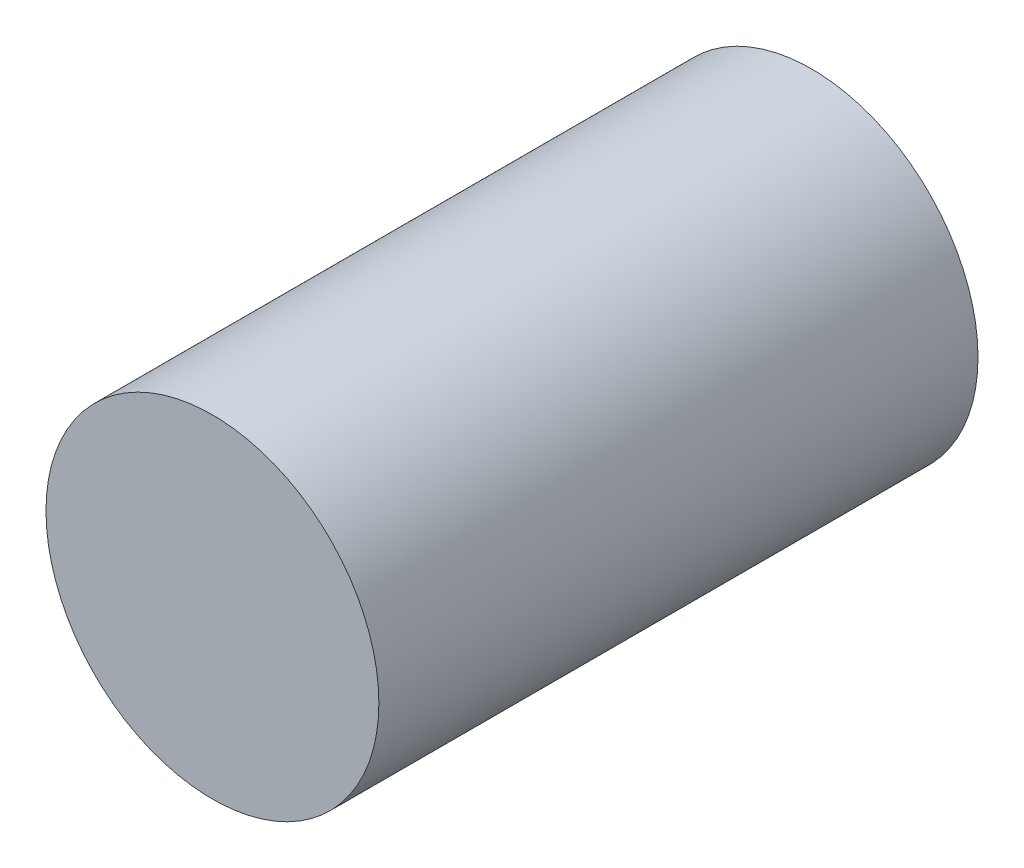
from build123d import *

# Parameters (mm, degrees)
SKETCH1_R           = 533.4
BOSS_EXTRUDE1_DEPTH = 1920.24


with BuildPart() as part:
    # Sketch1 → Boss-Extrude1 (new body)
    with BuildSketch(Plane(origin=(0, 0, 0), x_dir=(0, 1, 0), z_dir=(0, 0, 1))):
        with Locations(Location((0, 0, 0), (0, 0, 90))):
            Circle(SKETCH1_R)
    extrude(amount=BOSS_EXTRUDE1_DEPTH)


solid = part.part
